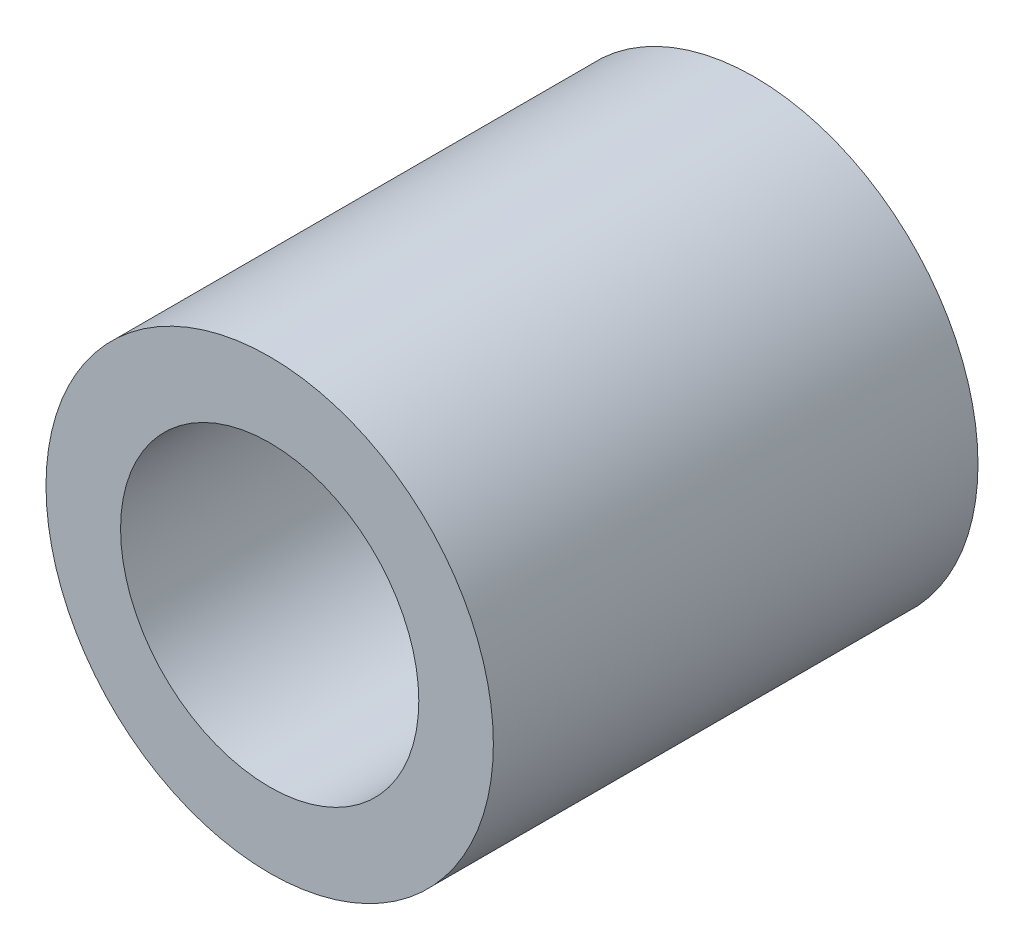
ISO-10303-21;
HEADER;
FILE_DESCRIPTION(('STEP AP214'),'2;1');
FILE_NAME('part.step','',(''),(''),'','','');
FILE_SCHEMA(('AUTOMOTIVE_DESIGN { 1 0 10303 214 1 1 1 1 }'));
ENDSEC;
DATA;
#1=APPLICATION_CONTEXT('core data for automotive mechanical design processes');
#2=APPLICATION_PROTOCOL_DEFINITION('international standard','automotive_design',2000,#1);
#3=PRODUCT_CONTEXT('',#1,'mechanical');
#4=PRODUCT('Part','Part','',(#3));
#5=PRODUCT_RELATED_PRODUCT_CATEGORY('part','',(#4));
#6=PRODUCT_DEFINITION_FORMATION('','',#4);
#7=PRODUCT_DEFINITION_CONTEXT('part definition',#1,'design');
#8=PRODUCT_DEFINITION('design','',#6,#7);
#9=PRODUCT_DEFINITION_SHAPE('','',#8);
#10=(LENGTH_UNIT() NAMED_UNIT(*) SI_UNIT(.MILLI.,.METRE.));
#11=(NAMED_UNIT(*) PLANE_ANGLE_UNIT() SI_UNIT($,.RADIAN.));
#12=(NAMED_UNIT(*) SI_UNIT($,.STERADIAN.) SOLID_ANGLE_UNIT());
#13=UNCERTAINTY_MEASURE_WITH_UNIT(LENGTH_MEASURE(1.E-05),#10,'distance_accuracy_value','');
#14=(GEOMETRIC_REPRESENTATION_CONTEXT(3) GLOBAL_UNCERTAINTY_ASSIGNED_CONTEXT((#13)) GLOBAL_UNIT_ASSIGNED_CONTEXT((#10,
#11,#12)) REPRESENTATION_CONTEXT('',''));
#15=CARTESIAN_POINT('',(0.,0.,0.));
#16=DIRECTION('',(0.,0.,1.));
#17=DIRECTION('',(1.,0.,0.));
#18=AXIS2_PLACEMENT_3D('',#15,#16,#17);
#19=CARTESIAN_POINT('',(0.,0.,6.5));
#20=DIRECTION('',(0.,0.,1.));
#21=DIRECTION('',(1.,0.,0.));
#22=AXIS2_PLACEMENT_3D('',#19,#20,#21);
#23=PLANE('',#22);
#24=CARTESIAN_POINT('',(0.,0.,6.5));
#25=DIRECTION('',(0.,0.,1.));
#26=DIRECTION('',(1.,0.,0.));
#27=AXIS2_PLACEMENT_3D('',#24,#25,#26);
#28=CIRCLE('',#27,3.);
#29=CARTESIAN_POINT('',(-3.,0.,6.5));
#30=VERTEX_POINT('',#29);
#31=EDGE_CURVE('E10',#30,#30,#28,.T.);
#32=ORIENTED_EDGE('',*,*,#31,.T.);
#33=EDGE_LOOP('',(#32));
#34=FACE_BOUND('',#33,.T.);
#35=CARTESIAN_POINT('',(0.,0.,6.5));
#36=DIRECTION('',(0.,0.,1.));
#37=DIRECTION('',(1.,0.,0.));
#38=AXIS2_PLACEMENT_3D('',#35,#36,#37);
#39=CIRCLE('',#38,2.);
#40=CARTESIAN_POINT('',(-2.,0.,6.5));
#41=VERTEX_POINT('',#40);
#42=EDGE_CURVE('E35',#41,#41,#39,.T.);
#43=ORIENTED_EDGE('',*,*,#42,.F.);
#44=EDGE_LOOP('',(#43));
#45=FACE_BOUND('',#44,.T.);
#46=ADVANCED_FACE('F24',(#34,#45),#23,.T.);
#47=CARTESIAN_POINT('',(0.,0.,0.));
#48=DIRECTION('',(0.,0.,1.));
#49=DIRECTION('',(1.,0.,0.));
#50=AXIS2_PLACEMENT_3D('',#47,#48,#49);
#51=PLANE('',#50);
#52=CARTESIAN_POINT('',(0.,0.,0.));
#53=DIRECTION('',(0.,0.,1.));
#54=DIRECTION('',(1.,0.,0.));
#55=AXIS2_PLACEMENT_3D('',#52,#53,#54);
#56=CIRCLE('',#55,3.);
#57=CARTESIAN_POINT('',(-3.,0.,0.));
#58=VERTEX_POINT('',#57);
#59=EDGE_CURVE('E31',#58,#58,#56,.T.);
#60=ORIENTED_EDGE('',*,*,#59,.F.);
#61=EDGE_LOOP('',(#60));
#62=FACE_BOUND('',#61,.T.);
#63=CARTESIAN_POINT('',(0.,0.,0.));
#64=DIRECTION('',(0.,0.,1.));
#65=DIRECTION('',(1.,0.,0.));
#66=AXIS2_PLACEMENT_3D('',#63,#64,#65);
#67=CIRCLE('',#66,2.);
#68=CARTESIAN_POINT('',(-2.,0.,0.));
#69=VERTEX_POINT('',#68);
#70=EDGE_CURVE('E39',#69,#69,#67,.T.);
#71=ORIENTED_EDGE('',*,*,#70,.T.);
#72=EDGE_LOOP('',(#71));
#73=FACE_BOUND('',#72,.T.);
#74=ADVANCED_FACE('F45',(#62,#73),#51,.F.);
#75=CARTESIAN_POINT('',(0.,0.,6.5));
#76=DIRECTION('',(0.,0.,-1.));
#77=DIRECTION('',(-1.,0.,0.));
#78=AXIS2_PLACEMENT_3D('',#75,#76,#77);
#79=CYLINDRICAL_SURFACE('',#78,3.);
#80=CARTESIAN_POINT('',(-3.,0.,6.5));
#81=CARTESIAN_POINT('',(-3.,0.,6.43229166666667));
#82=CARTESIAN_POINT('',(-3.,0.,6.36458333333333));
#83=CARTESIAN_POINT('',(-3.,0.,6.22916666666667));
#84=CARTESIAN_POINT('',(-3.,0.,6.16145833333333));
#85=CARTESIAN_POINT('',(-3.,0.,6.02604166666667));
#86=CARTESIAN_POINT('',(-3.,0.,5.95833333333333));
#87=CARTESIAN_POINT('',(-3.,0.,5.82291666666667));
#88=CARTESIAN_POINT('',(-3.,0.,5.75520833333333));
#89=CARTESIAN_POINT('',(-3.,0.,5.61979166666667));
#90=CARTESIAN_POINT('',(-3.,0.,5.55208333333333));
#91=CARTESIAN_POINT('',(-3.,0.,5.41666666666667));
#92=CARTESIAN_POINT('',(-3.,0.,5.34895833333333));
#93=CARTESIAN_POINT('',(-3.,0.,5.21354166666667));
#94=CARTESIAN_POINT('',(-3.,0.,5.14583333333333));
#95=CARTESIAN_POINT('',(-3.,0.,5.01041666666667));
#96=CARTESIAN_POINT('',(-3.,0.,4.94270833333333));
#97=CARTESIAN_POINT('',(-3.,0.,4.80729166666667));
#98=CARTESIAN_POINT('',(-3.,0.,4.73958333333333));
#99=CARTESIAN_POINT('',(-3.,0.,4.60416666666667));
#100=CARTESIAN_POINT('',(-3.,0.,4.53645833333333));
#101=CARTESIAN_POINT('',(-3.,0.,4.40104166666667));
#102=CARTESIAN_POINT('',(-3.,0.,4.33333333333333));
#103=CARTESIAN_POINT('',(-3.,0.,4.19791666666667));
#104=CARTESIAN_POINT('',(-3.,0.,4.13020833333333));
#105=CARTESIAN_POINT('',(-3.,0.,3.99479166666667));
#106=CARTESIAN_POINT('',(-3.,0.,3.92708333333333));
#107=CARTESIAN_POINT('',(-3.,0.,3.79166666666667));
#108=CARTESIAN_POINT('',(-3.,0.,3.72395833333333));
#109=CARTESIAN_POINT('',(-3.,0.,3.58854166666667));
#110=CARTESIAN_POINT('',(-3.,0.,3.52083333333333));
#111=CARTESIAN_POINT('',(-3.,0.,3.38541666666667));
#112=CARTESIAN_POINT('',(-3.,0.,3.31770833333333));
#113=CARTESIAN_POINT('',(-3.,0.,3.18229166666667));
#114=CARTESIAN_POINT('',(-3.,0.,3.11458333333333));
#115=CARTESIAN_POINT('',(-3.,0.,2.97916666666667));
#116=CARTESIAN_POINT('',(-3.,0.,2.91145833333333));
#117=CARTESIAN_POINT('',(-3.,0.,2.77604166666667));
#118=CARTESIAN_POINT('',(-3.,0.,2.70833333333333));
#119=CARTESIAN_POINT('',(-3.,0.,2.57291666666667));
#120=CARTESIAN_POINT('',(-3.,0.,2.50520833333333));
#121=CARTESIAN_POINT('',(-3.,0.,2.36979166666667));
#122=CARTESIAN_POINT('',(-3.,0.,2.30208333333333));
#123=CARTESIAN_POINT('',(-3.,0.,2.16666666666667));
#124=CARTESIAN_POINT('',(-3.,0.,2.09895833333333));
#125=CARTESIAN_POINT('',(-3.,0.,1.96354166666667));
#126=CARTESIAN_POINT('',(-3.,0.,1.89583333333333));
#127=CARTESIAN_POINT('',(-3.,0.,1.76041666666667));
#128=CARTESIAN_POINT('',(-3.,0.,1.69270833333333));
#129=CARTESIAN_POINT('',(-3.,0.,1.55729166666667));
#130=CARTESIAN_POINT('',(-3.,0.,1.48958333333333));
#131=CARTESIAN_POINT('',(-3.,0.,1.35416666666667));
#132=CARTESIAN_POINT('',(-3.,0.,1.28645833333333));
#133=CARTESIAN_POINT('',(-3.,0.,1.15104166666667));
#134=CARTESIAN_POINT('',(-3.,0.,1.08333333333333));
#135=CARTESIAN_POINT('',(-3.,0.,0.947916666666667));
#136=CARTESIAN_POINT('',(-3.,0.,0.880208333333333));
#137=CARTESIAN_POINT('',(-3.,0.,0.744791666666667));
#138=CARTESIAN_POINT('',(-3.,0.,0.677083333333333));
#139=CARTESIAN_POINT('',(-3.,0.,0.541666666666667));
#140=CARTESIAN_POINT('',(-3.,0.,0.473958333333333));
#141=CARTESIAN_POINT('',(-3.,0.,0.338541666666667));
#142=CARTESIAN_POINT('',(-3.,0.,0.270833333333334));
#143=CARTESIAN_POINT('',(-3.,0.,0.135416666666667));
#144=CARTESIAN_POINT('',(-3.,0.,0.0677083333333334));
#145=CARTESIAN_POINT('',(-3.,0.,0.));
#146=B_SPLINE_CURVE_WITH_KNOTS('',3,(#80,#81,#82,#83,#84,#85,#86,#87,#88,#89,#90,#91,#92,#93,
#94,#95,#96,#97,#98,#99,#100,#101,#102,#103,#104,#105,#106,#107,#108,#109,#110,#111,#112,#113,
#114,#115,#116,#117,#118,#119,#120,#121,#122,#123,#124,#125,#126,#127,#128,#129,#130,#131,#132,
#133,#134,#135,#136,#137,#138,#139,#140,#141,#142,#143,#144,#145),.UNSPECIFIED.,.F.,.F.,(4,2,2,
2,2,2,2,2,2,2,2,2,2,2,2,2,2,2,2,2,2,2,2,2,2,2,2,2,2,2,2,2,4),(0.,0.203125,0.40625,
0.609375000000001,0.812500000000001,1.015625,1.21875,1.421875,1.625,1.828125,2.03125,2.234375,
2.4375,2.640625,2.84375,3.046875,3.25,3.453125,3.65625,3.859375,4.0625,4.265625,4.46875,
4.671875,4.875,5.078125,5.28125,5.484375,5.6875,5.890625,6.09375,6.296875,6.5),.UNSPECIFIED.);
#147=EDGE_CURVE('BSEAM26',#30,#58,#146,.T.);
#148=ORIENTED_EDGE('',*,*,#31,.F.);
#149=ORIENTED_EDGE('',*,*,#59,.T.);
#150=ORIENTED_EDGE('',*,*,#147,.T.);
#151=ORIENTED_EDGE('',*,*,#147,.F.);
#152=EDGE_LOOP('',(#148,#150,#149,#151));
#153=FACE_BOUND('',#152,.T.);
#154=ADVANCED_FACE('F26',(#153),#79,.T.);
#155=CARTESIAN_POINT('',(0.,0.,6.5));
#156=DIRECTION('',(0.,0.,-1.));
#157=DIRECTION('',(-1.,0.,0.));
#158=AXIS2_PLACEMENT_3D('',#155,#156,#157);
#159=CYLINDRICAL_SURFACE('',#158,2.);
#160=CARTESIAN_POINT('',(-2.,0.,6.5));
#161=CARTESIAN_POINT('',(-2.,0.,6.43229166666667));
#162=CARTESIAN_POINT('',(-2.,0.,6.36458333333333));
#163=CARTESIAN_POINT('',(-2.,0.,6.22916666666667));
#164=CARTESIAN_POINT('',(-2.,0.,6.16145833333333));
#165=CARTESIAN_POINT('',(-2.,0.,6.02604166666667));
#166=CARTESIAN_POINT('',(-2.,0.,5.95833333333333));
#167=CARTESIAN_POINT('',(-2.,0.,5.82291666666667));
#168=CARTESIAN_POINT('',(-2.,0.,5.75520833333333));
#169=CARTESIAN_POINT('',(-2.,0.,5.61979166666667));
#170=CARTESIAN_POINT('',(-2.,0.,5.55208333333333));
#171=CARTESIAN_POINT('',(-2.,0.,5.41666666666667));
#172=CARTESIAN_POINT('',(-2.,0.,5.34895833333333));
#173=CARTESIAN_POINT('',(-2.,0.,5.21354166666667));
#174=CARTESIAN_POINT('',(-2.,0.,5.14583333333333));
#175=CARTESIAN_POINT('',(-2.,0.,5.01041666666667));
#176=CARTESIAN_POINT('',(-2.,0.,4.94270833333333));
#177=CARTESIAN_POINT('',(-2.,0.,4.80729166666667));
#178=CARTESIAN_POINT('',(-2.,0.,4.73958333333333));
#179=CARTESIAN_POINT('',(-2.,0.,4.60416666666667));
#180=CARTESIAN_POINT('',(-2.,0.,4.53645833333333));
#181=CARTESIAN_POINT('',(-2.,0.,4.40104166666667));
#182=CARTESIAN_POINT('',(-2.,0.,4.33333333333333));
#183=CARTESIAN_POINT('',(-2.,0.,4.19791666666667));
#184=CARTESIAN_POINT('',(-2.,0.,4.13020833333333));
#185=CARTESIAN_POINT('',(-2.,0.,3.99479166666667));
#186=CARTESIAN_POINT('',(-2.,0.,3.92708333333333));
#187=CARTESIAN_POINT('',(-2.,0.,3.79166666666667));
#188=CARTESIAN_POINT('',(-2.,0.,3.72395833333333));
#189=CARTESIAN_POINT('',(-2.,0.,3.58854166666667));
#190=CARTESIAN_POINT('',(-2.,0.,3.52083333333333));
#191=CARTESIAN_POINT('',(-2.,0.,3.38541666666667));
#192=CARTESIAN_POINT('',(-2.,0.,3.31770833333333));
#193=CARTESIAN_POINT('',(-2.,0.,3.18229166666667));
#194=CARTESIAN_POINT('',(-2.,0.,3.11458333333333));
#195=CARTESIAN_POINT('',(-2.,0.,2.97916666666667));
#196=CARTESIAN_POINT('',(-2.,0.,2.91145833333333));
#197=CARTESIAN_POINT('',(-2.,0.,2.77604166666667));
#198=CARTESIAN_POINT('',(-2.,0.,2.70833333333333));
#199=CARTESIAN_POINT('',(-2.,0.,2.57291666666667));
#200=CARTESIAN_POINT('',(-2.,0.,2.50520833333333));
#201=CARTESIAN_POINT('',(-2.,0.,2.36979166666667));
#202=CARTESIAN_POINT('',(-2.,0.,2.30208333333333));
#203=CARTESIAN_POINT('',(-2.,0.,2.16666666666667));
#204=CARTESIAN_POINT('',(-2.,0.,2.09895833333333));
#205=CARTESIAN_POINT('',(-2.,0.,1.96354166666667));
#206=CARTESIAN_POINT('',(-2.,0.,1.89583333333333));
#207=CARTESIAN_POINT('',(-2.,0.,1.76041666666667));
#208=CARTESIAN_POINT('',(-2.,0.,1.69270833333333));
#209=CARTESIAN_POINT('',(-2.,0.,1.55729166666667));
#210=CARTESIAN_POINT('',(-2.,0.,1.48958333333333));
#211=CARTESIAN_POINT('',(-2.,0.,1.35416666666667));
#212=CARTESIAN_POINT('',(-2.,0.,1.28645833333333));
#213=CARTESIAN_POINT('',(-2.,0.,1.15104166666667));
#214=CARTESIAN_POINT('',(-2.,0.,1.08333333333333));
#215=CARTESIAN_POINT('',(-2.,0.,0.947916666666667));
#216=CARTESIAN_POINT('',(-2.,0.,0.880208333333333));
#217=CARTESIAN_POINT('',(-2.,0.,0.744791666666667));
#218=CARTESIAN_POINT('',(-2.,0.,0.677083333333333));
#219=CARTESIAN_POINT('',(-2.,0.,0.541666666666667));
#220=CARTESIAN_POINT('',(-2.,0.,0.473958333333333));
#221=CARTESIAN_POINT('',(-2.,0.,0.338541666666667));
#222=CARTESIAN_POINT('',(-2.,0.,0.270833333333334));
#223=CARTESIAN_POINT('',(-2.,0.,0.135416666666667));
#224=CARTESIAN_POINT('',(-2.,0.,0.0677083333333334));
#225=CARTESIAN_POINT('',(-2.,0.,0.));
#226=B_SPLINE_CURVE_WITH_KNOTS('',3,(#160,#161,#162,#163,#164,#165,#166,#167,#168,#169,#170,
#171,#172,#173,#174,#175,#176,#177,#178,#179,#180,#181,#182,#183,#184,#185,#186,#187,#188,#189,
#190,#191,#192,#193,#194,#195,#196,#197,#198,#199,#200,#201,#202,#203,#204,#205,#206,#207,#208,
#209,#210,#211,#212,#213,#214,#215,#216,#217,#218,#219,#220,#221,#222,#223,#224,#225),
.UNSPECIFIED.,.F.,.F.,(4,2,2,2,2,2,2,2,2,2,2,2,2,2,2,2,2,2,2,2,2,2,2,2,2,2,2,2,2,2,2,2,4),(0.,
0.203124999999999,0.40625,0.609375,0.812499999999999,1.015625,1.21875,1.421875,1.625,1.828125,
2.03125,2.234375,2.4375,2.640625,2.84375,3.046875,3.25,3.453125,3.65625,3.859375,4.0625,
4.265625,4.46875,4.671875,4.875,5.078125,5.28125,5.484375,5.6875,5.890625,6.09375,6.296875,6.5),.UNSPECIFIED.);
#227=EDGE_CURVE('BSEAM47',#41,#69,#226,.T.);
#228=ORIENTED_EDGE('',*,*,#42,.T.);
#229=ORIENTED_EDGE('',*,*,#70,.F.);
#230=ORIENTED_EDGE('',*,*,#227,.T.);
#231=ORIENTED_EDGE('',*,*,#227,.F.);
#232=EDGE_LOOP('',(#228,#230,#229,#231));
#233=FACE_BOUND('',#232,.T.);
#234=ADVANCED_FACE('F47',(#233),#159,.F.);
#235=CLOSED_SHELL('',(#46,#74,#154,#234));
#236=MANIFOLD_SOLID_BREP('B2',#235);
#237=ADVANCED_BREP_SHAPE_REPRESENTATION('',(#18,#236),#14);
#238=SHAPE_DEFINITION_REPRESENTATION(#9,#237);
ENDSEC;
END-ISO-10303-21;
